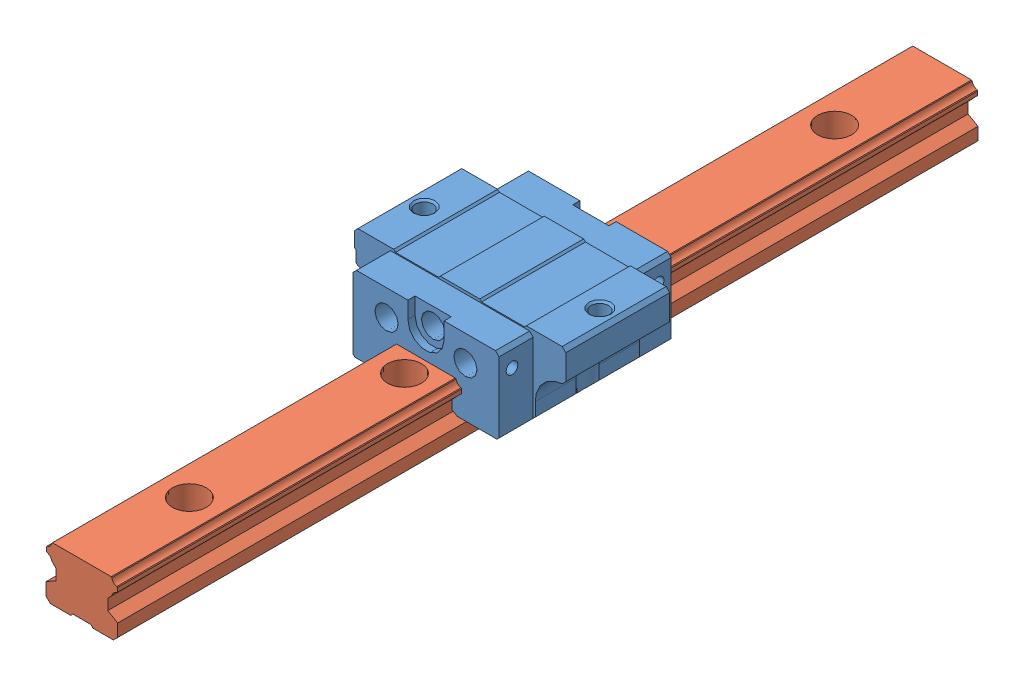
SolidWorks assembly ELW20SA1R240 E=30.sldasm, configuration Default (file format 13000). Lengths in mm.
Overall size (59 28 240).
2 component instances, 2 part files, 0 mates.
Components (placement in the parent):
- ELW20SA-1: ELW20SA.SLDPRT [Default] at (0 28 -96) size (59 22 48)
- ELR20R240 E=30-1: ELR20R240 E=30.SLDPRT [Default] at (0 28 0) size (20 15 240)
